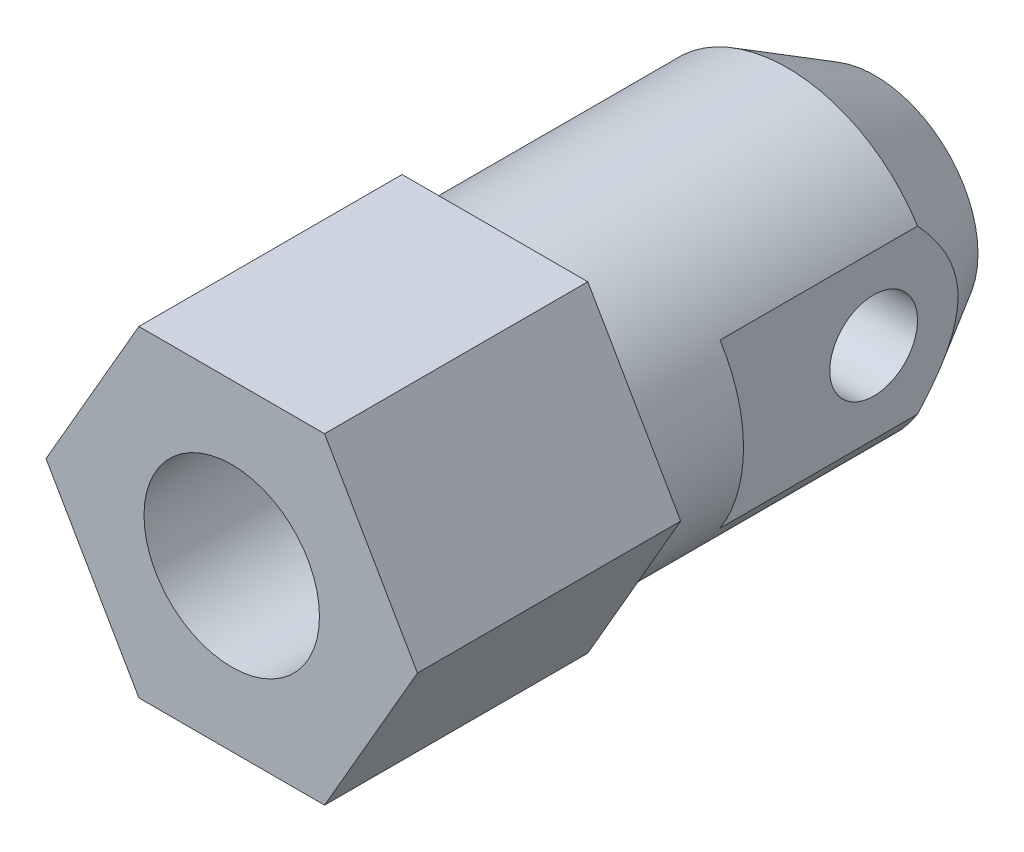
ISO-10303-21;
HEADER;
FILE_DESCRIPTION(('STEP AP214'),'2;1');
FILE_NAME('part.step','',(''),(''),'','','');
FILE_SCHEMA(('AUTOMOTIVE_DESIGN { 1 0 10303 214 1 1 1 1 }'));
ENDSEC;
DATA;
#1=APPLICATION_CONTEXT('core data for automotive mechanical design processes');
#2=APPLICATION_PROTOCOL_DEFINITION('international standard','automotive_design',2000,#1);
#3=PRODUCT_CONTEXT('',#1,'mechanical');
#4=PRODUCT('Part','Part','',(#3));
#5=PRODUCT_RELATED_PRODUCT_CATEGORY('part','',(#4));
#6=PRODUCT_DEFINITION_FORMATION('','',#4);
#7=PRODUCT_DEFINITION_CONTEXT('part definition',#1,'design');
#8=PRODUCT_DEFINITION('design','',#6,#7);
#9=PRODUCT_DEFINITION_SHAPE('','',#8);
#10=(LENGTH_UNIT() NAMED_UNIT(*) SI_UNIT(.MILLI.,.METRE.));
#11=(NAMED_UNIT(*) PLANE_ANGLE_UNIT() SI_UNIT($,.RADIAN.));
#12=(NAMED_UNIT(*) SI_UNIT($,.STERADIAN.) SOLID_ANGLE_UNIT());
#13=UNCERTAINTY_MEASURE_WITH_UNIT(LENGTH_MEASURE(1.E-05),#10,'distance_accuracy_value','');
#14=(GEOMETRIC_REPRESENTATION_CONTEXT(3) GLOBAL_UNCERTAINTY_ASSIGNED_CONTEXT((#13)) GLOBAL_UNIT_ASSIGNED_CONTEXT((#10,
#11,#12)) REPRESENTATION_CONTEXT('',''));
#15=CARTESIAN_POINT('',(0.,0.,0.));
#16=DIRECTION('',(0.,0.,1.));
#17=DIRECTION('',(1.,0.,0.));
#18=AXIS2_PLACEMENT_3D('',#15,#16,#17);
#19=CARTESIAN_POINT('',(0.,0.,15.));
#20=DIRECTION('',(0.,0.,-1.));
#21=DIRECTION('',(1.,0.,0.));
#22=AXIS2_PLACEMENT_3D('',#19,#20,#21);
#23=CYLINDRICAL_SURFACE('',#22,10.5);
#24=CARTESIAN_POINT('',(0.,0.,17.));
#25=DIRECTION('',(0.,0.,-1.));
#26=DIRECTION('',(1.,0.,0.));
#27=AXIS2_PLACEMENT_3D('',#24,#25,#26);
#28=CIRCLE('',#27,10.5);
#29=CARTESIAN_POINT('',(10.5,0.,17.));
#30=VERTEX_POINT('',#29);
#31=EDGE_CURVE('E9',#30,#30,#28,.F.);
#32=ORIENTED_EDGE('',*,*,#31,.F.);
#33=EDGE_LOOP('',(#32));
#34=FACE_BOUND('',#33,.T.);
#35=CARTESIAN_POINT('',(0.,0.,-3.));
#36=DIRECTION('',(0.,0.,-1.));
#37=DIRECTION('',(1.,0.,0.));
#38=AXIS2_PLACEMENT_3D('',#35,#36,#37);
#39=CIRCLE('',#38,10.5);
#40=CARTESIAN_POINT('',(-8.9,5.57135531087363,-3.));
#41=VERTEX_POINT('',#40);
#42=CARTESIAN_POINT('',(8.9,5.57135531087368,-3.));
#43=VERTEX_POINT('',#42);
#44=EDGE_CURVE('E174',#41,#43,#39,.T.);
#45=ORIENTED_EDGE('',*,*,#44,.F.);
#46=DIRECTION('',(0.,0.,-1.));
#47=VECTOR('',#46,1.);
#48=CARTESIAN_POINT('',(-8.9,5.57135531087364,15.));
#49=LINE('',#48,#47);
#50=CARTESIAN_POINT('',(-8.9,5.57135531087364,10.5));
#51=VERTEX_POINT('',#50);
#52=EDGE_CURVE('E29',#41,#51,#49,.F.);
#53=ORIENTED_EDGE('',*,*,#52,.T.);
#54=CARTESIAN_POINT('',(0.,0.,10.5));
#55=DIRECTION('',(0.,0.,1.));
#56=DIRECTION('',(-1.,0.,0.));
#57=AXIS2_PLACEMENT_3D('',#54,#55,#56);
#58=CIRCLE('',#57,10.5);
#59=CARTESIAN_POINT('',(-8.9,-5.57135531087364,10.5));
#60=VERTEX_POINT('',#59);
#61=EDGE_CURVE('E22',#60,#51,#58,.F.);
#62=ORIENTED_EDGE('',*,*,#61,.F.);
#63=DIRECTION('',(0.,0.,-1.));
#64=VECTOR('',#63,1.);
#65=CARTESIAN_POINT('',(-8.9,-5.57135531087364,15.));
#66=LINE('',#65,#64);
#67=CARTESIAN_POINT('',(-8.9,-5.57135531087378,-3.));
#68=VERTEX_POINT('',#67);
#69=EDGE_CURVE('E162',#60,#68,#66,.T.);
#70=ORIENTED_EDGE('',*,*,#69,.T.);
#71=CARTESIAN_POINT('',(8.9,-5.57135531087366,-3.));
#72=VERTEX_POINT('',#71);
#73=EDGE_CURVE('E175',#72,#68,#39,.T.);
#74=ORIENTED_EDGE('',*,*,#73,.F.);
#75=DIRECTION('',(0.,0.,-1.));
#76=VECTOR('',#75,1.);
#77=CARTESIAN_POINT('',(8.9,-5.57135531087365,15.));
#78=LINE('',#77,#76);
#79=CARTESIAN_POINT('',(8.9,-5.57135531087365,10.5));
#80=VERTEX_POINT('',#79);
#81=EDGE_CURVE('E37',#80,#72,#78,.T.);
#82=ORIENTED_EDGE('',*,*,#81,.F.);
#83=CARTESIAN_POINT('',(0.,0.,10.5));
#84=DIRECTION('',(0.,0.,-1.));
#85=DIRECTION('',(1.,0.,0.));
#86=AXIS2_PLACEMENT_3D('',#83,#84,#85);
#87=CIRCLE('',#86,10.5);
#88=CARTESIAN_POINT('',(8.9,5.57135531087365,10.5));
#89=VERTEX_POINT('',#88);
#90=EDGE_CURVE('E186',#80,#89,#87,.F.);
#91=ORIENTED_EDGE('',*,*,#90,.T.);
#92=DIRECTION('',(0.,0.,-1.));
#93=VECTOR('',#92,1.);
#94=CARTESIAN_POINT('',(8.9,5.57135531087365,15.));
#95=LINE('',#94,#93);
#96=EDGE_CURVE('E169',#43,#89,#95,.F.);
#97=ORIENTED_EDGE('',*,*,#96,.F.);
#98=EDGE_LOOP('',(#45,#53,#62,#70,#74,#82,#91,#97));
#99=FACE_BOUND('',#98,.T.);
#100=ADVANCED_FACE('F14',(#34,#99),#23,.T.);
#101=CARTESIAN_POINT('',(0.,0.,-9.));
#102=DIRECTION('',(0.,0.,1.));
#103=DIRECTION('',(-1.,0.,0.));
#104=AXIS2_PLACEMENT_3D('',#101,#102,#103);
#105=CONICAL_SURFACE('',#104,7.03589838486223,0.523598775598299);
#106=CARTESIAN_POINT('',(0.,0.,-9.));
#107=DIRECTION('',(0.,0.,-1.));
#108=DIRECTION('',(1.,0.,0.));
#109=AXIS2_PLACEMENT_3D('',#106,#107,#108);
#110=CIRCLE('',#109,7.03589838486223);
#111=CARTESIAN_POINT('',(7.03589838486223,0.,-9.));
#112=VERTEX_POINT('',#111);
#113=EDGE_CURVE('E171',#112,#112,#110,.T.);
#114=ORIENTED_EDGE('',*,*,#113,.F.);
#115=EDGE_LOOP('',(#114));
#116=FACE_BOUND('',#115,.T.);
#117=ORIENTED_EDGE('',*,*,#73,.T.);
#118=CARTESIAN_POINT('',(-8.9,14.6906497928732,8.56368625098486));
#119=CARTESIAN_POINT('',(-8.9,14.3724086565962,8.09233145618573));
#120=CARTESIAN_POINT('',(-8.9,14.0523322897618,7.62220251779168));
#121=CARTESIAN_POINT('',(-8.9,13.407548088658,6.68501890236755));
#122=CARTESIAN_POINT('',(-8.9,13.0828394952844,6.21796474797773));
#123=CARTESIAN_POINT('',(-8.9,12.4255724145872,5.28435443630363));
#124=CARTESIAN_POINT('',(-8.9,12.0929741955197,4.8178261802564));
#125=CARTESIAN_POINT('',(-8.9,11.4209532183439,3.88977196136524));
#126=CARTESIAN_POINT('',(-8.9,11.0815311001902,3.428245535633));
#127=CARTESIAN_POINT('',(-8.9,10.3609340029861,2.46727414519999));
#128=CARTESIAN_POINT('',(-8.9,9.97889352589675,1.96847406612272));
#129=CARTESIAN_POINT('',(-8.9,9.39571279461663,1.22810811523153));
#130=CARTESIAN_POINT('',(-8.9,9.19959708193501,0.982582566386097));
#131=CARTESIAN_POINT('',(-8.9,8.8034796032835,0.494690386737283));
#132=CARTESIAN_POINT('',(-8.9,8.60347794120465,0.252323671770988));
#133=CARTESIAN_POINT('',(-8.9,8.19961550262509,-0.227845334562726));
#134=CARTESIAN_POINT('',(-8.9,7.99576927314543,-0.465659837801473));
#135=CARTESIAN_POINT('',(-8.9,7.58284404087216,-0.936691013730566));
#136=CARTESIAN_POINT('',(-8.9,7.37376534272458,-1.16990795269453));
#137=CARTESIAN_POINT('',(-8.9,6.94954847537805,-1.63054276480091));
#138=CARTESIAN_POINT('',(-8.9,6.73441369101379,-1.85796374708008));
#139=CARTESIAN_POINT('',(-8.9,6.29685389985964,-2.30565666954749));
#140=CARTESIAN_POINT('',(-8.9,6.07443011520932,-2.52592979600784));
#141=CARTESIAN_POINT('',(-8.9,5.72815075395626,-2.85526733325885));
#142=CARTESIAN_POINT('',(-8.9,5.60744255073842,-2.96764547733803));
#143=CARTESIAN_POINT('',(-8.9,5.36335255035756,-3.18947146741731));
#144=CARTESIAN_POINT('',(-8.9,5.23997070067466,-3.29891925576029));
#145=CARTESIAN_POINT('',(-8.9,4.99019185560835,-3.51449813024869));
#146=CARTESIAN_POINT('',(-8.9,4.86379293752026,-3.62062699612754));
#147=CARTESIAN_POINT('',(-8.9,4.60777909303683,-3.82892309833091));
#148=CARTESIAN_POINT('',(-8.9,4.47816421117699,-3.93109038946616));
#149=CARTESIAN_POINT('',(-8.9,4.0869351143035,-4.22849536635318));
#150=CARTESIAN_POINT('',(-8.90000000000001,3.82016647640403,-4.41706407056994));
#151=CARTESIAN_POINT('',(-8.9,3.27068989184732,-4.76924752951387));
#152=CARTESIAN_POINT('',(-8.9,2.98800127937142,-4.93289169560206));
#153=CARTESIAN_POINT('',(-8.9,2.55061558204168,-5.15255427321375));
#154=CARTESIAN_POINT('',(-8.9,2.40241326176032,-5.22154020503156));
#155=CARTESIAN_POINT('',(-8.9,2.10165294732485,-5.34932813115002));
#156=CARTESIAN_POINT('',(-8.9,1.94909533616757,-5.40813101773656));
#157=CARTESIAN_POINT('',(-8.9,1.64010234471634,-5.51391020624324));
#158=CARTESIAN_POINT('',(-8.90000000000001,1.48367177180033,-5.56090043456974));
#159=CARTESIAN_POINT('',(-8.9,1.16742727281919,-5.64158779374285));
#160=CARTESIAN_POINT('',(-8.9,1.00761423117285,-5.67528835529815));
#161=CARTESIAN_POINT('',(-8.9,0.683771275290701,-5.72840104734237));
#162=CARTESIAN_POINT('',(-8.9,0.519714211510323,-5.74764967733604));
#163=CARTESIAN_POINT('',(-8.90000000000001,0.190509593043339,-5.77038116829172));
#164=CARTESIAN_POINT('',(-8.9,0.025362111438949,-5.77386507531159));
#165=CARTESIAN_POINT('',(-8.9,-0.30442363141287,-5.76490886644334));
#166=CARTESIAN_POINT('',(-8.9,-0.469062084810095,-5.75247575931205));
#167=CARTESIAN_POINT('',(-8.9,-0.796447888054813,-5.71226632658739));
#168=CARTESIAN_POINT('',(-8.9,-0.959194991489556,-5.68448802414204));
#169=CARTESIAN_POINT('',(-8.9,-1.30407432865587,-5.60987762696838));
#170=CARTESIAN_POINT('',(-8.9,-1.48574670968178,-5.56092941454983));
#171=CARTESIAN_POINT('',(-8.90000000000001,-1.84395793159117,-5.4468573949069));
#172=CARTESIAN_POINT('',(-8.9,-2.02049430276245,-5.38172594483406));
#173=CARTESIAN_POINT('',(-8.9,-2.36948052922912,-5.2370400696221));
#174=CARTESIAN_POINT('',(-8.9,-2.5418751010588,-5.15735356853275));
#175=CARTESIAN_POINT('',(-8.9,-2.8806874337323,-4.98633931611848));
#176=CARTESIAN_POINT('',(-8.9,-3.0471064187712,-4.8950139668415));
#177=CARTESIAN_POINT('',(-8.9,-3.4129408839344,-4.6799946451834));
#178=CARTESIAN_POINT('',(-8.9,-3.61085279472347,-4.55375330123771));
#179=CARTESIAN_POINT('',(-8.90000000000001,-3.99879031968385,-4.28962524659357));
#180=CARTESIAN_POINT('',(-8.9,-4.18881244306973,-4.15173346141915));
#181=CARTESIAN_POINT('',(-8.9,-4.56236330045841,-3.86628685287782));
#182=CARTESIAN_POINT('',(-8.9,-4.74586966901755,-3.7187029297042));
#183=CARTESIAN_POINT('',(-8.9,-5.10659178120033,-3.41613209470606));
#184=CARTESIAN_POINT('',(-8.9,-5.28380851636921,-3.26114635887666));
#185=CARTESIAN_POINT('',(-8.9,-5.62449488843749,-2.95264657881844));
#186=CARTESIAN_POINT('',(-8.9,-5.78821792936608,-2.79941118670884));
#187=CARTESIAN_POINT('',(-8.9,-6.11130761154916,-2.48840096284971));
#188=CARTESIAN_POINT('',(-8.9,-6.27067390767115,-2.33062577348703));
#189=CARTESIAN_POINT('',(-8.9,-6.58433981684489,-2.01253017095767));
#190=CARTESIAN_POINT('',(-8.9,-6.73866911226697,-1.85223893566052));
#191=CARTESIAN_POINT('',(-8.9,-7.04392315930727,-1.52852687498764));
#192=CARTESIAN_POINT('',(-8.9,-7.19484883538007,-1.3651069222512));
#193=CARTESIAN_POINT('',(-8.9,-7.34430663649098,-1.200375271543));
#194=B_SPLINE_CURVE_WITH_KNOTS('',3,(#118,#119,#120,#121,#122,#123,#124,#125,#126,#127,#128,
#129,#130,#131,#132,#133,#134,#135,#136,#137,#138,#139,#140,#141,#142,#143,#144,#145,#146,#147,
#148,#149,#150,#151,#152,#153,#154,#155,#156,#157,#158,#159,#160,#161,#162,#163,#164,#165,#166,
#167,#168,#169,#170,#171,#172,#173,#174,#175,#176,#177,#178,#179,#180,#181,#182,#183,#184,#185,
#186,#187,#188,#189,#190,#191,#192,#193),.UNSPECIFIED.,.F.,.F.,(4,2,2,2,2,2,2,2,2,2,2,2,2,2,2,2,
2,2,2,2,2,2,2,2,2,2,2,2,2,2,2,2,2,2,2,2,2,4),(0.,1.70619901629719,3.41268092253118,
5.13147394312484,6.85010651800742,8.73479437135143,9.67747072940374,10.6201219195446,
11.5597291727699,12.4992818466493,13.4383194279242,14.3772003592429,14.8719277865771,
15.3666649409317,15.8617262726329,16.3567807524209,17.335861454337,18.3137777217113,
18.8038864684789,19.2939522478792,19.7834375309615,20.2727963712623,20.7676113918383,
21.2623935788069,21.7569579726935,22.251586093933,22.8151573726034,23.3789953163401,
23.94822975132,24.5173468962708,25.2210484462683,25.9250580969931,26.6312877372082,
27.3374055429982,28.0100429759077,28.6827335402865,29.3502139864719,30.0175109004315),.UNSPECIFIED.);
#195=EDGE_CURVE('E197',#68,#41,#194,.F.);
#196=ORIENTED_EDGE('',*,*,#195,.T.);
#197=ORIENTED_EDGE('',*,*,#44,.T.);
#198=CARTESIAN_POINT('',(8.9,14.6906497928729,8.56368625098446));
#199=CARTESIAN_POINT('',(8.9,14.3724086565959,8.09233145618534));
#200=CARTESIAN_POINT('',(8.9,14.0523322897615,7.62220251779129));
#201=CARTESIAN_POINT('',(8.9,13.4075480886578,6.68501890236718));
#202=CARTESIAN_POINT('',(8.9,13.0828394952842,6.21796474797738));
#203=CARTESIAN_POINT('',(8.9,12.425572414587,5.2843544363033));
#204=CARTESIAN_POINT('',(8.9,12.0929741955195,4.81782618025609));
#205=CARTESIAN_POINT('',(8.9,11.4209532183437,3.88977196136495));
#206=CARTESIAN_POINT('',(8.9,11.08153110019,3.42824553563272));
#207=CARTESIAN_POINT('',(8.9,10.3609340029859,2.46727414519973));
#208=CARTESIAN_POINT('',(8.9,9.97889352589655,1.96847406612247));
#209=CARTESIAN_POINT('',(8.9,9.39571279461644,1.2281081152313));
#210=CARTESIAN_POINT('',(8.9,9.19959708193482,0.982582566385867));
#211=CARTESIAN_POINT('',(8.9,8.80347960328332,0.494690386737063));
#212=CARTESIAN_POINT('',(8.9,8.60347794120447,0.252323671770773));
#213=CARTESIAN_POINT('',(8.9,8.19961550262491,-0.227845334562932));
#214=CARTESIAN_POINT('',(8.9,7.99576927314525,-0.465659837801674));
#215=CARTESIAN_POINT('',(8.9,7.58284404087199,-0.936691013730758));
#216=CARTESIAN_POINT('',(8.9,7.37376534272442,-1.16990795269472));
#217=CARTESIAN_POINT('',(8.9,6.94954847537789,-1.63054276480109));
#218=CARTESIAN_POINT('',(8.9,6.73441369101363,-1.85796374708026));
#219=CARTESIAN_POINT('',(8.9,6.29685389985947,-2.30565666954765));
#220=CARTESIAN_POINT('',(8.9,6.07443011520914,-2.52592979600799));
#221=CARTESIAN_POINT('',(8.9,5.72815075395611,-2.85526733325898));
#222=CARTESIAN_POINT('',(8.9,5.60744255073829,-2.96764547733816));
#223=CARTESIAN_POINT('',(8.9,5.36335255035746,-3.18947146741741));
#224=CARTESIAN_POINT('',(8.9,5.23997070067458,-3.29891925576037));
#225=CARTESIAN_POINT('',(8.9,4.99019185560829,-3.51449813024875));
#226=CARTESIAN_POINT('',(8.9,4.86379293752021,-3.62062699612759));
#227=CARTESIAN_POINT('',(8.9,4.60777909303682,-3.82892309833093));
#228=CARTESIAN_POINT('',(8.9,4.47816421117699,-3.93109038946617));
#229=CARTESIAN_POINT('',(8.9,4.08693511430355,-4.22849536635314));
#230=CARTESIAN_POINT('',(8.9,3.82016647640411,-4.41706407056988));
#231=CARTESIAN_POINT('',(8.9,3.27068989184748,-4.76924752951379));
#232=CARTESIAN_POINT('',(8.9,2.98800127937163,-4.93289169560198));
#233=CARTESIAN_POINT('',(8.9,2.55061558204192,-5.15255427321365));
#234=CARTESIAN_POINT('',(8.9,2.40241326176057,-5.22154020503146));
#235=CARTESIAN_POINT('',(8.9,2.10165294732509,-5.34932813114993));
#236=CARTESIAN_POINT('',(8.9,1.94909533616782,-5.40813101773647));
#237=CARTESIAN_POINT('',(8.9,1.64010234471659,-5.51391020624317));
#238=CARTESIAN_POINT('',(8.9,1.48367177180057,-5.56090043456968));
#239=CARTESIAN_POINT('',(8.9,1.16742727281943,-5.6415877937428));
#240=CARTESIAN_POINT('',(8.9,1.00761423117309,-5.67528835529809));
#241=CARTESIAN_POINT('',(8.9,0.683771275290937,-5.72840104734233));
#242=CARTESIAN_POINT('',(8.9,0.519714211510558,-5.74764967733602));
#243=CARTESIAN_POINT('',(8.9,0.190509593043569,-5.77038116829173));
#244=CARTESIAN_POINT('',(8.9,0.0253621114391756,-5.7738650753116));
#245=CARTESIAN_POINT('',(8.9,-0.304423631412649,-5.76490886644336));
#246=CARTESIAN_POINT('',(8.9,-0.469062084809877,-5.75247575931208));
#247=CARTESIAN_POINT('',(8.9,-0.796447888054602,-5.71226632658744));
#248=CARTESIAN_POINT('',(8.9,-0.95919499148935,-5.68448802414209));
#249=CARTESIAN_POINT('',(8.9,-1.30407432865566,-5.60987762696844));
#250=CARTESIAN_POINT('',(8.9,-1.48574670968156,-5.5609294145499));
#251=CARTESIAN_POINT('',(8.9,-1.84395793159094,-5.44685739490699));
#252=CARTESIAN_POINT('',(8.9,-2.02049430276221,-5.38172594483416));
#253=CARTESIAN_POINT('',(8.9,-2.36948052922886,-5.23704006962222));
#254=CARTESIAN_POINT('',(8.9,-2.54187510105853,-5.15735356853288));
#255=CARTESIAN_POINT('',(8.9,-2.88068743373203,-4.98633931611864));
#256=CARTESIAN_POINT('',(8.9,-3.04710641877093,-4.89501396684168));
#257=CARTESIAN_POINT('',(8.9,-3.4129408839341,-4.67999464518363));
#258=CARTESIAN_POINT('',(8.9,-3.61085279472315,-4.55375330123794));
#259=CARTESIAN_POINT('',(8.9,-3.99879031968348,-4.28962524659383));
#260=CARTESIAN_POINT('',(8.9,-4.18881244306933,-4.15173346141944));
#261=CARTESIAN_POINT('',(8.9,-4.56236330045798,-3.86628685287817));
#262=CARTESIAN_POINT('',(8.9,-4.7458696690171,-3.71870292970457));
#263=CARTESIAN_POINT('',(8.9,-5.10659178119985,-3.41613209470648));
#264=CARTESIAN_POINT('',(8.9,-5.28380851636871,-3.26114635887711));
#265=CARTESIAN_POINT('',(8.9,-5.62449488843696,-2.95264657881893));
#266=CARTESIAN_POINT('',(8.9,-5.78821792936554,-2.79941118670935));
#267=CARTESIAN_POINT('',(8.9,-6.11130761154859,-2.48840096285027));
#268=CARTESIAN_POINT('',(8.9,-6.27067390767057,-2.33062577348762));
#269=CARTESIAN_POINT('',(8.9,-6.58433981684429,-2.0125301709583));
#270=CARTESIAN_POINT('',(8.9,-6.73866911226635,-1.85223893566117));
#271=CARTESIAN_POINT('',(8.9,-7.04392315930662,-1.52852687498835));
#272=CARTESIAN_POINT('',(8.9,-7.1948488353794,-1.36510692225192));
#273=CARTESIAN_POINT('',(8.9,-7.3443066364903,-1.20037527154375));
#274=B_SPLINE_CURVE_WITH_KNOTS('',3,(#198,#199,#200,#201,#202,#203,#204,#205,#206,#207,#208,
#209,#210,#211,#212,#213,#214,#215,#216,#217,#218,#219,#220,#221,#222,#223,#224,#225,#226,#227,
#228,#229,#230,#231,#232,#233,#234,#235,#236,#237,#238,#239,#240,#241,#242,#243,#244,#245,#246,
#247,#248,#249,#250,#251,#252,#253,#254,#255,#256,#257,#258,#259,#260,#261,#262,#263,#264,#265,
#266,#267,#268,#269,#270,#271,#272,#273),.UNSPECIFIED.,.F.,.F.,(4,2,2,2,2,2,2,2,2,2,2,2,2,2,2,2,
2,2,2,2,2,2,2,2,2,2,2,2,2,2,2,2,2,2,2,2,2,4),(0.,1.70619901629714,3.4126809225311,
5.13147394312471,6.85010651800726,8.73479437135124,9.67747072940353,10.6201219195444,
11.5597291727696,12.499281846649,13.4383194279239,14.3772003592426,14.8719277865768,
15.3666649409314,15.8617262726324,16.3567807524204,17.3358614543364,18.3137777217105,
18.8038864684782,19.2939522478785,19.7834375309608,20.2727963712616,20.7676113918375,
21.2623935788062,21.7569579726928,22.2515860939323,22.8151573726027,23.3789953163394,
23.9482297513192,24.51734689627,25.2210484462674,25.9250580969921,26.6312877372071,
27.337405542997,28.0100429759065,28.6827335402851,29.3502139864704,30.01751090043),.UNSPECIFIED.);
#275=EDGE_CURVE('E178',#72,#43,#274,.F.);
#276=ORIENTED_EDGE('',*,*,#275,.F.);
#277=EDGE_LOOP('',(#117,#196,#197,#276));
#278=FACE_BOUND('',#277,.T.);
#279=ADVANCED_FACE('F191',(#116,#278),#105,.T.);
#280=CARTESIAN_POINT('',(0.,-7.03589838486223,-9.));
#281=DIRECTION('',(0.,0.,1.));
#282=DIRECTION('',(-1.,0.,0.));
#283=AXIS2_PLACEMENT_3D('',#280,#281,#282);
#284=PLANE('',#283);
#285=ORIENTED_EDGE('',*,*,#113,.T.);
#286=EDGE_LOOP('',(#285));
#287=FACE_BOUND('',#286,.T.);
#288=ADVANCED_FACE('F16',(#287),#284,.F.);
#289=CARTESIAN_POINT('',(8.9,15.,10.5));
#290=DIRECTION('',(0.,0.,-1.));
#291=DIRECTION('',(1.,0.,0.));
#292=AXIS2_PLACEMENT_3D('',#289,#290,#291);
#293=PLANE('',#292);
#294=DIRECTION('',(0.,-1.,0.));
#295=VECTOR('',#294,1.);
#296=CARTESIAN_POINT('',(8.9,15.,10.5));
#297=LINE('',#296,#295);
#298=EDGE_CURVE('E166',#89,#80,#297,.T.);
#299=ORIENTED_EDGE('',*,*,#298,.F.);
#300=ORIENTED_EDGE('',*,*,#90,.F.);
#301=EDGE_LOOP('',(#299,#300));
#302=FACE_BOUND('',#301,.T.);
#303=ADVANCED_FACE('F215',(#302),#293,.T.);
#304=CARTESIAN_POINT('',(8.9,15.,10.5));
#305=DIRECTION('',(-1.,0.,0.));
#306=DIRECTION('',(0.,0.,-1.));
#307=AXIS2_PLACEMENT_3D('',#304,#305,#306);
#308=PLANE('',#307);
#309=CARTESIAN_POINT('',(8.9,0.,0.));
#310=DIRECTION('',(1.,0.,0.));
#311=DIRECTION('',(0.,0.,1.));
#312=AXIS2_PLACEMENT_3D('',#309,#310,#311);
#313=CIRCLE('',#312,3.);
#314=CARTESIAN_POINT('',(8.9,0.,3.));
#315=VERTEX_POINT('',#314);
#316=EDGE_CURVE('E155',#315,#315,#313,.T.);
#317=ORIENTED_EDGE('',*,*,#316,.F.);
#318=EDGE_LOOP('',(#317));
#319=FACE_BOUND('',#318,.T.);
#320=ORIENTED_EDGE('',*,*,#96,.T.);
#321=ORIENTED_EDGE('',*,*,#298,.T.);
#322=ORIENTED_EDGE('',*,*,#81,.T.);
#323=ORIENTED_EDGE('',*,*,#275,.T.);
#324=EDGE_LOOP('',(#320,#321,#322,#323));
#325=FACE_BOUND('',#324,.T.);
#326=ADVANCED_FACE('F188',(#319,#325),#308,.F.);
#327=CARTESIAN_POINT('',(-8.9,15.,10.5));
#328=DIRECTION('',(-1.,0.,0.));
#329=DIRECTION('',(0.,0.,-1.));
#330=AXIS2_PLACEMENT_3D('',#327,#328,#329);
#331=PLANE('',#330);
#332=CARTESIAN_POINT('',(-8.9,0.,0.));
#333=DIRECTION('',(-1.,0.,0.));
#334=DIRECTION('',(0.,0.,-1.));
#335=AXIS2_PLACEMENT_3D('',#332,#333,#334);
#336=CIRCLE('',#335,3.);
#337=CARTESIAN_POINT('',(-8.9,0.,-3.));
#338=VERTEX_POINT('',#337);
#339=EDGE_CURVE('E158',#338,#338,#336,.T.);
#340=ORIENTED_EDGE('',*,*,#339,.F.);
#341=EDGE_LOOP('',(#340));
#342=FACE_BOUND('',#341,.T.);
#343=ORIENTED_EDGE('',*,*,#195,.F.);
#344=ORIENTED_EDGE('',*,*,#69,.F.);
#345=DIRECTION('',(0.,-1.,0.));
#346=VECTOR('',#345,1.);
#347=CARTESIAN_POINT('',(-8.9,15.,10.5));
#348=LINE('',#347,#346);
#349=EDGE_CURVE('E159',#51,#60,#348,.T.);
#350=ORIENTED_EDGE('',*,*,#349,.F.);
#351=ORIENTED_EDGE('',*,*,#52,.F.);
#352=EDGE_LOOP('',(#343,#344,#350,#351));
#353=FACE_BOUND('',#352,.T.);
#354=ADVANCED_FACE('F204',(#342,#353),#331,.T.);
#355=CARTESIAN_POINT('',(-8.9,15.,10.5));
#356=DIRECTION('',(0.,0.,1.));
#357=DIRECTION('',(-1.,0.,0.));
#358=AXIS2_PLACEMENT_3D('',#355,#356,#357);
#359=PLANE('',#358);
#360=ORIENTED_EDGE('',*,*,#61,.T.);
#361=ORIENTED_EDGE('',*,*,#349,.T.);
#362=EDGE_LOOP('',(#360,#361));
#363=FACE_BOUND('',#362,.T.);
#364=ADVANCED_FACE('F209',(#363),#359,.F.);
#365=CARTESIAN_POINT('',(-10.5,0.,0.));
#366=DIRECTION('',(1.,0.,0.));
#367=DIRECTION('',(0.,0.,1.));
#368=AXIS2_PLACEMENT_3D('',#365,#366,#367);
#369=CYLINDRICAL_SURFACE('',#368,3.);
#370=ORIENTED_EDGE('',*,*,#339,.T.);
#371=EDGE_LOOP('',(#370));
#372=FACE_BOUND('',#371,.T.);
#373=ORIENTED_EDGE('',*,*,#316,.T.);
#374=EDGE_LOOP('',(#373));
#375=FACE_BOUND('',#374,.T.);
#376=ADVANCED_FACE('F211',(#372,#375),#369,.F.);
#377=CARTESIAN_POINT('',(-6.35085296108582,11.,17.));
#378=DIRECTION('',(-0.86602540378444,0.5,0.));
#379=DIRECTION('',(0.5,0.86602540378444,0.));
#380=AXIS2_PLACEMENT_3D('',#377,#378,#379);
#381=PLANE('',#380);
#382=DIRECTION('',(0.,0.,1.));
#383=VECTOR('',#382,1.);
#384=CARTESIAN_POINT('',(-6.35085296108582,11.,17.));
#385=LINE('',#384,#383);
#386=CARTESIAN_POINT('',(-6.35085296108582,11.,17.));
#387=VERTEX_POINT('',#386);
#388=CARTESIAN_POINT('',(-6.35085296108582,11.,35.));
#389=VERTEX_POINT('',#388);
#390=EDGE_CURVE('E153',#387,#389,#385,.T.);
#391=ORIENTED_EDGE('',*,*,#390,.F.);
#392=DIRECTION('',(-0.5,-0.86602540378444,0.));
#393=VECTOR('',#392,1.);
#394=CARTESIAN_POINT('',(-6.35085296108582,11.,17.));
#395=LINE('',#394,#393);
#396=CARTESIAN_POINT('',(-12.7017059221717,0.,17.));
#397=VERTEX_POINT('',#396);
#398=EDGE_CURVE('E100',#387,#397,#395,.T.);
#399=ORIENTED_EDGE('',*,*,#398,.T.);
#400=DIRECTION('',(0.,0.,1.));
#401=VECTOR('',#400,1.);
#402=CARTESIAN_POINT('',(-12.7017059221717,0.,17.));
#403=LINE('',#402,#401);
#404=CARTESIAN_POINT('',(-12.7017059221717,0.,35.));
#405=VERTEX_POINT('',#404);
#406=EDGE_CURVE('E94',#397,#405,#403,.T.);
#407=ORIENTED_EDGE('',*,*,#406,.T.);
#408=DIRECTION('',(-0.5,-0.86602540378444,0.));
#409=VECTOR('',#408,1.);
#410=CARTESIAN_POINT('',(-6.35085296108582,11.,35.));
#411=LINE('',#410,#409);
#412=EDGE_CURVE('E97',#389,#405,#411,.T.);
#413=ORIENTED_EDGE('',*,*,#412,.F.);
#414=EDGE_LOOP('',(#391,#399,#407,#413));
#415=FACE_BOUND('',#414,.T.);
#416=ADVANCED_FACE('F96',(#415),#381,.T.);
#417=CARTESIAN_POINT('',(6.35085296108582,11.,17.));
#418=DIRECTION('',(0.,1.,0.));
#419=DIRECTION('',(0.,0.,1.));
#420=AXIS2_PLACEMENT_3D('',#417,#418,#419);
#421=PLANE('',#420);
#422=DIRECTION('',(0.,0.,1.));
#423=VECTOR('',#422,1.);
#424=CARTESIAN_POINT('',(6.35085296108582,11.,17.));
#425=LINE('',#424,#423);
#426=CARTESIAN_POINT('',(6.35085296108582,11.,17.));
#427=VERTEX_POINT('',#426);
#428=CARTESIAN_POINT('',(6.35085296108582,11.,35.));
#429=VERTEX_POINT('',#428);
#430=EDGE_CURVE('E151',#427,#429,#425,.T.);
#431=ORIENTED_EDGE('',*,*,#430,.F.);
#432=DIRECTION('',(-1.,0.,0.));
#433=VECTOR('',#432,1.);
#434=CARTESIAN_POINT('',(6.35085296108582,11.,17.));
#435=LINE('',#434,#433);
#436=EDGE_CURVE('E106',#427,#387,#435,.T.);
#437=ORIENTED_EDGE('',*,*,#436,.T.);
#438=ORIENTED_EDGE('',*,*,#390,.T.);
#439=DIRECTION('',(-1.,0.,0.));
#440=VECTOR('',#439,1.);
#441=CARTESIAN_POINT('',(6.35085296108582,11.,35.));
#442=LINE('',#441,#440);
#443=EDGE_CURVE('E116',#429,#389,#442,.T.);
#444=ORIENTED_EDGE('',*,*,#443,.F.);
#445=EDGE_LOOP('',(#431,#437,#438,#444));
#446=FACE_BOUND('',#445,.T.);
#447=ADVANCED_FACE('F246',(#446),#421,.T.);
#448=CARTESIAN_POINT('',(6.35085296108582,11.,17.));
#449=DIRECTION('',(-0.86602540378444,-0.5,0.));
#450=DIRECTION('',(-0.5,0.86602540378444,0.));
#451=AXIS2_PLACEMENT_3D('',#448,#449,#450);
#452=PLANE('',#451);
#453=DIRECTION('',(0.,0.,1.));
#454=VECTOR('',#453,1.);
#455=CARTESIAN_POINT('',(12.7017059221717,0.,17.));
#456=LINE('',#455,#454);
#457=CARTESIAN_POINT('',(12.7017059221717,0.,17.));
#458=VERTEX_POINT('',#457);
#459=CARTESIAN_POINT('',(12.7017059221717,0.,35.));
#460=VERTEX_POINT('',#459);
#461=EDGE_CURVE('E149',#458,#460,#456,.T.);
#462=ORIENTED_EDGE('',*,*,#461,.F.);
#463=DIRECTION('',(0.5,-0.86602540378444,0.));
#464=VECTOR('',#463,1.);
#465=CARTESIAN_POINT('',(6.35085296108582,11.,17.));
#466=LINE('',#465,#464);
#467=EDGE_CURVE('E141',#427,#458,#466,.T.);
#468=ORIENTED_EDGE('',*,*,#467,.F.);
#469=ORIENTED_EDGE('',*,*,#430,.T.);
#470=DIRECTION('',(0.5,-0.86602540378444,0.));
#471=VECTOR('',#470,1.);
#472=CARTESIAN_POINT('',(6.35085296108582,11.,35.));
#473=LINE('',#472,#471);
#474=EDGE_CURVE('E128',#429,#460,#473,.T.);
#475=ORIENTED_EDGE('',*,*,#474,.T.);
#476=EDGE_LOOP('',(#462,#468,#469,#475));
#477=FACE_BOUND('',#476,.T.);
#478=ADVANCED_FACE('F249',(#477),#452,.F.);
#479=CARTESIAN_POINT('',(6.35085296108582,-11.,17.));
#480=DIRECTION('',(0.86602540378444,-0.5,0.));
#481=DIRECTION('',(-0.5,-0.86602540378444,0.));
#482=AXIS2_PLACEMENT_3D('',#479,#480,#481);
#483=PLANE('',#482);
#484=DIRECTION('',(0.,0.,1.));
#485=VECTOR('',#484,1.);
#486=CARTESIAN_POINT('',(6.35085296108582,-11.,17.));
#487=LINE('',#486,#485);
#488=CARTESIAN_POINT('',(6.35085296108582,-11.,17.));
#489=VERTEX_POINT('',#488);
#490=CARTESIAN_POINT('',(6.35085296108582,-11.,35.));
#491=VERTEX_POINT('',#490);
#492=EDGE_CURVE('E147',#489,#491,#487,.T.);
#493=ORIENTED_EDGE('',*,*,#492,.F.);
#494=DIRECTION('',(0.5,0.86602540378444,0.));
#495=VECTOR('',#494,1.);
#496=CARTESIAN_POINT('',(6.35085296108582,-11.,17.));
#497=LINE('',#496,#495);
#498=EDGE_CURVE('E138',#489,#458,#497,.T.);
#499=ORIENTED_EDGE('',*,*,#498,.T.);
#500=ORIENTED_EDGE('',*,*,#461,.T.);
#501=DIRECTION('',(0.5,0.86602540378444,0.));
#502=VECTOR('',#501,1.);
#503=CARTESIAN_POINT('',(6.35085296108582,-11.,35.));
#504=LINE('',#503,#502);
#505=EDGE_CURVE('E122',#491,#460,#504,.T.);
#506=ORIENTED_EDGE('',*,*,#505,.F.);
#507=EDGE_LOOP('',(#493,#499,#500,#506));
#508=FACE_BOUND('',#507,.T.);
#509=ADVANCED_FACE('F253',(#508),#483,.T.);
#510=CARTESIAN_POINT('',(6.35085296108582,-11.,17.));
#511=DIRECTION('',(0.,1.,0.));
#512=DIRECTION('',(0.,0.,1.));
#513=AXIS2_PLACEMENT_3D('',#510,#511,#512);
#514=PLANE('',#513);
#515=DIRECTION('',(0.,0.,1.));
#516=VECTOR('',#515,1.);
#517=CARTESIAN_POINT('',(-6.35085296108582,-11.,17.));
#518=LINE('',#517,#516);
#519=CARTESIAN_POINT('',(-6.35085296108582,-11.,17.));
#520=VERTEX_POINT('',#519);
#521=CARTESIAN_POINT('',(-6.35085296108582,-11.,35.));
#522=VERTEX_POINT('',#521);
#523=EDGE_CURVE('E105',#520,#522,#518,.T.);
#524=ORIENTED_EDGE('',*,*,#523,.F.);
#525=DIRECTION('',(-1.,0.,0.));
#526=VECTOR('',#525,1.);
#527=CARTESIAN_POINT('',(6.35085296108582,-11.,17.));
#528=LINE('',#527,#526);
#529=EDGE_CURVE('E135',#489,#520,#528,.T.);
#530=ORIENTED_EDGE('',*,*,#529,.F.);
#531=ORIENTED_EDGE('',*,*,#492,.T.);
#532=DIRECTION('',(-1.,0.,0.));
#533=VECTOR('',#532,1.);
#534=CARTESIAN_POINT('',(6.35085296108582,-11.,35.));
#535=LINE('',#534,#533);
#536=EDGE_CURVE('E120',#491,#522,#535,.T.);
#537=ORIENTED_EDGE('',*,*,#536,.T.);
#538=EDGE_LOOP('',(#524,#530,#531,#537));
#539=FACE_BOUND('',#538,.T.);
#540=ADVANCED_FACE('F243',(#539),#514,.F.);
#541=CARTESIAN_POINT('',(-6.35085296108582,-11.,17.));
#542=DIRECTION('',(0.86602540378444,0.5,0.));
#543=DIRECTION('',(0.5,-0.86602540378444,0.));
#544=AXIS2_PLACEMENT_3D('',#541,#542,#543);
#545=PLANE('',#544);
#546=DIRECTION('',(-0.5,0.86602540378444,0.));
#547=VECTOR('',#546,1.);
#548=CARTESIAN_POINT('',(-6.35085296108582,-11.,17.));
#549=LINE('',#548,#547);
#550=EDGE_CURVE('E133',#520,#397,#549,.T.);
#551=ORIENTED_EDGE('',*,*,#550,.F.);
#552=ORIENTED_EDGE('',*,*,#523,.T.);
#553=DIRECTION('',(-0.5,0.86602540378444,0.));
#554=VECTOR('',#553,1.);
#555=CARTESIAN_POINT('',(-6.35085296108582,-11.,35.));
#556=LINE('',#555,#554);
#557=EDGE_CURVE('E112',#522,#405,#556,.T.);
#558=ORIENTED_EDGE('',*,*,#557,.T.);
#559=ORIENTED_EDGE('',*,*,#406,.F.);
#560=EDGE_LOOP('',(#551,#552,#558,#559));
#561=FACE_BOUND('',#560,.T.);
#562=ADVANCED_FACE('F119',(#561),#545,.F.);
#563=CARTESIAN_POINT('',(-19.0525588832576,-11.,17.));
#564=DIRECTION('',(0.,0.,-1.));
#565=DIRECTION('',(1.,0.,0.));
#566=AXIS2_PLACEMENT_3D('',#563,#564,#565);
#567=PLANE('',#566);
#568=ORIENTED_EDGE('',*,*,#31,.T.);
#569=EDGE_LOOP('',(#568));
#570=FACE_BOUND('',#569,.T.);
#571=ORIENTED_EDGE('',*,*,#398,.F.);
#572=ORIENTED_EDGE('',*,*,#436,.F.);
#573=ORIENTED_EDGE('',*,*,#467,.T.);
#574=ORIENTED_EDGE('',*,*,#498,.F.);
#575=ORIENTED_EDGE('',*,*,#529,.T.);
#576=ORIENTED_EDGE('',*,*,#550,.T.);
#577=EDGE_LOOP('',(#571,#572,#573,#574,#575,#576));
#578=FACE_BOUND('',#577,.T.);
#579=ADVANCED_FACE('F239',(#570,#578),#567,.T.);
#580=CARTESIAN_POINT('',(0.,0.,35.));
#581=DIRECTION('',(0.,0.,-1.));
#582=DIRECTION('',(1.,0.,0.));
#583=AXIS2_PLACEMENT_3D('',#580,#581,#582);
#584=PLANE('',#583);
#585=CARTESIAN_POINT('',(0.,0.,35.));
#586=DIRECTION('',(0.,0.,1.));
#587=DIRECTION('',(-1.,0.,0.));
#588=AXIS2_PLACEMENT_3D('',#585,#586,#587);
#589=CIRCLE('',#588,6.);
#590=CARTESIAN_POINT('',(-6.,0.,35.));
#591=VERTEX_POINT('',#590);
#592=EDGE_CURVE('E117',#591,#591,#589,.T.);
#593=ORIENTED_EDGE('',*,*,#592,.F.);
#594=EDGE_LOOP('',(#593));
#595=FACE_BOUND('',#594,.T.);
#596=ORIENTED_EDGE('',*,*,#412,.T.);
#597=ORIENTED_EDGE('',*,*,#557,.F.);
#598=ORIENTED_EDGE('',*,*,#536,.F.);
#599=ORIENTED_EDGE('',*,*,#505,.T.);
#600=ORIENTED_EDGE('',*,*,#474,.F.);
#601=ORIENTED_EDGE('',*,*,#443,.T.);
#602=EDGE_LOOP('',(#596,#597,#598,#599,#600,#601));
#603=FACE_BOUND('',#602,.T.);
#604=ADVANCED_FACE('F110',(#595,#603),#584,.F.);
#605=CARTESIAN_POINT('',(0.,0.,12.));
#606=DIRECTION('',(0.,0.,1.));
#607=DIRECTION('',(-1.,0.,0.));
#608=AXIS2_PLACEMENT_3D('',#605,#606,#607);
#609=CYLINDRICAL_SURFACE('',#608,6.);
#610=CARTESIAN_POINT('',(0.,0.,17.));
#611=DIRECTION('',(0.,0.,1.));
#612=DIRECTION('',(-1.,0.,0.));
#613=AXIS2_PLACEMENT_3D('',#610,#611,#612);
#614=CIRCLE('',#613,6.);
#615=CARTESIAN_POINT('',(-6.,0.,17.));
#616=VERTEX_POINT('',#615);
#617=EDGE_CURVE('E287',#616,#616,#614,.T.);
#618=ORIENTED_EDGE('',*,*,#617,.F.);
#619=EDGE_LOOP('',(#618));
#620=FACE_BOUND('',#619,.T.);
#621=ORIENTED_EDGE('',*,*,#592,.T.);
#622=EDGE_LOOP('',(#621));
#623=FACE_BOUND('',#622,.T.);
#624=ADVANCED_FACE('F276',(#620,#623),#609,.F.);
#625=CARTESIAN_POINT('',(0.,0.,17.));
#626=DIRECTION('',(0.,0.,1.));
#627=DIRECTION('',(-1.,0.,0.));
#628=AXIS2_PLACEMENT_3D('',#625,#626,#627);
#629=PLANE('',#628);
#630=ORIENTED_EDGE('',*,*,#617,.T.);
#631=EDGE_LOOP('',(#630));
#632=FACE_BOUND('',#631,.T.);
#633=ADVANCED_FACE('F279',(#632),#629,.T.);
#634=CLOSED_SHELL('',(#100,#279,#288,#303,#326,#354,#364,#376,#416,#447,#478,#509,#540,#562,
#579,#604,#624,#633));
#635=MANIFOLD_SOLID_BREP('B1',#634);
#636=ADVANCED_BREP_SHAPE_REPRESENTATION('',(#18,#635),#14);
#637=SHAPE_DEFINITION_REPRESENTATION(#9,#636);
ENDSEC;
END-ISO-10303-21;
